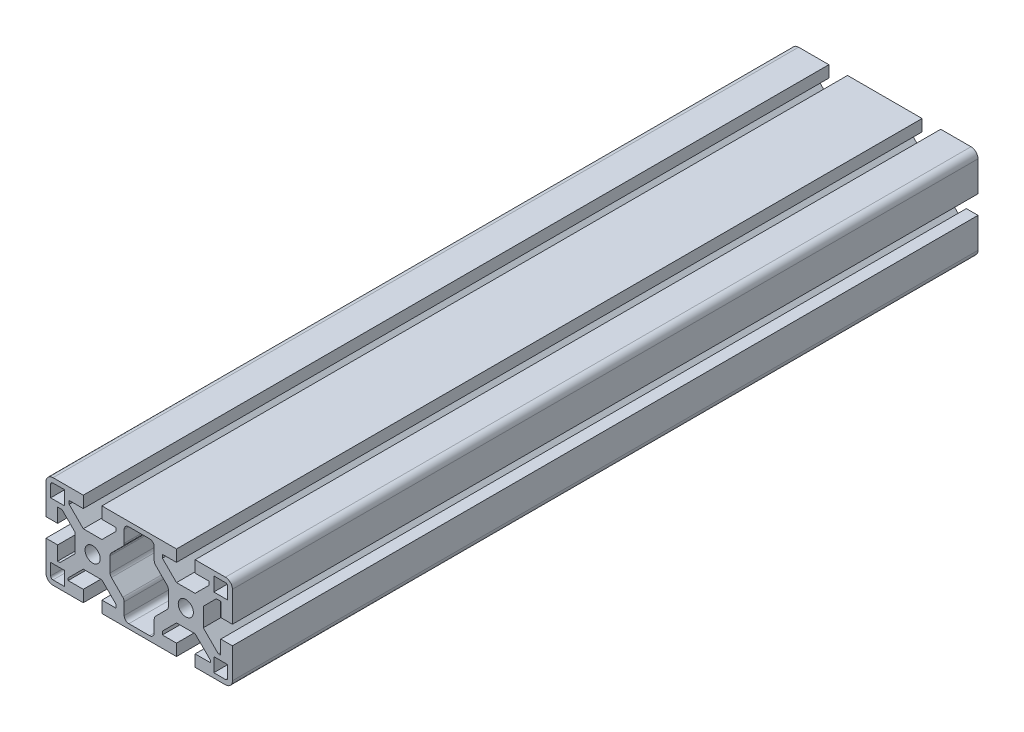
from build123d import *

# Parameters (mm, degrees)
CROQUIS1_R     = 3.25
EXTRUIR5_DEPTH = 320


with BuildPart() as part:
    # Croquis1 → Extruir5 (new body)
    with BuildSketch(Plane.XY):
        with BuildLine():
            Line((50.062875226, 13.55), (50.062875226, 15))
            Line((50.062875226, 15), (44, 15))
            Line((44, 15), (44, 20))
            Line((44, 20), (57, 20))
            ThreePointArc((57, 20), (59.121320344, 19.121320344), (60, 17))
            Line((60, 17), (60, 4))
            Line((60, 4), (55, 4))
            Line((55, 4), (55, 10.05))
            Line((55, 10.05), (53.1, 10.05))
            Line((53.1, 10.05), (47.5, 4.45))
            Line((47.5, 4.45), (47.5, -3.55))
            Line((47.5, -3.55), (54, -10.05))
            Line((54, -10.05), (55, -10.05))
            Line((55, -10.05), (55, -4))
            Line((55, -4), (60, -4))
            Line((60, -4), (60, -17))
            ThreePointArc((60, -17), (59.121320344, -19.121320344), (57, -20))
            Line((57, -20), (44, -20))
            Line((44, -20), (44, -15))
            Line((44, -15), (50.5, -15))
            Line((50.5, -15), (50.5, -14))
            Line((50.5, -14), (44, -7.5))
            Line((44, -7.5), (36, -7.5))
            Line((36, -7.5), (29.95, -13.55))
            Line((29.95, -13.55), (29.95, -15))
            Line((29.95, -15), (36, -15))
            Line((36, -15), (36, -20))
            Line((36, -20), (4, -20))
            Line((4, -20), (4, -15))
            Line((4, -15), (10.05, -15))
            Line((10.05, -15), (10.05, -13.55))
            Line((10.05, -13.55), (4, -7.5))
            Line((4, -7.5), (-4, -7.5))
            Line((-4, -7.5), (-10.5, -14))
            Line((-10.5, -14), (-10.5, -15))
            Line((-10.5, -15), (-4, -15))
            Line((-4, -15), (-4, -20))
            Line((-4, -20), (-17, -20))
            ThreePointArc((-17, -20), (-19.121320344, -19.121320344), (-20, -17))
            Line((-20, -17), (-20, -4))
            Line((-20, -4), (-15, -4))
            Line((-15, -4), (-15, -10.05))
            Line((-15, -10.05), (-14, -10.05))
            Line((-14, -10.05), (-7.5, -3.55))
            Line((-7.5, -3.55), (-7.5, 4.45))
            Line((-7.5, 4.45), (-13.1, 10.05))
            Line((-13.1, 10.05), (-15, 10.05))
            Line((-15, 10.05), (-15, 4))
            Line((-15, 4), (-20, 4))
            Line((-20, 4), (-20, 17))
            ThreePointArc((-20, 17), (-19.121320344, 19.121320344), (-17, 20))
            Line((-17, 20), (-4, 20))
            Line((-4, 20), (-4, 15))
            Line((-4, 15), (-10.062875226, 15))
            Line((-10.062875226, 15), (-10.062875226, 13.55))
            Line((-10.062875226, 13.55), (-4, 7.5))
            Line((-4, 7.5), (4, 7.5))
            Line((4, 7.5), (10.05, 13.55))
            Line((10.05, 13.55), (10.05, 15))
            Line((10.05, 15), (4, 15))
            Line((4, 15), (4, 20))
            Line((4, 20), (36, 20))
            Line((36, 20), (36, 15))
            Line((36, 15), (29.95, 15))
            Line((29.95, 15), (29.95, 13.55))
            Line((29.95, 13.55), (36, 7.5))
            Line((36, 7.5), (44, 7.5))
            Line((44, 7.5), (50.062875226, 13.55))
        make_face()
        Circle(CROQUIS1_R, mode=Mode.SUBTRACT)
        with Locations(Location((40, 0, 0), (0, 0, 180))):
            Circle(CROQUIS1_R, mode=Mode.SUBTRACT)
        with BuildLine():
            Line((-18, 12), (-12, 12))
            Line((-12, 12), (-12, 18))
            Line((-12, 18), (-17, 18))
            ThreePointArc((-17, 18), (-17.707106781, 17.707106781), (-18, 17))
            Line((-18, 17), (-18, 12))
        make_face(mode=Mode.SUBTRACT)
        with BuildLine():
            Line((24.45, 18), (15.55, 18))
            ThreePointArc((15.55, 18), (14.135786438, 17.414213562), (13.55, 16))
            Line((13.55, 16), (13.55, 10.878427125))
            ThreePointArc((13.55, 10.878427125), (13.397759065, 10.11306026), (12.964213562, 9.464213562))
            Line((12.964213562, 9.464213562), (8.085786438, 4.585786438))
            ThreePointArc((8.085786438, 4.585786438), (7.652240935, 3.93693974), (7.5, 3.171572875))
            Line((7.5, 3.171572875), (7.5, -3.171572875))
            ThreePointArc((7.5, -3.171572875), (7.652240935, -3.93693974), (8.085786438, -4.585786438))
            Line((8.085786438, -4.585786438), (12.964213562, -9.464213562))
            ThreePointArc((12.964213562, -9.464213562), (13.397759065, -10.11306026), (13.55, -10.878427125))
            Line((13.55, -10.878427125), (13.55, -16))
            ThreePointArc((13.55, -16), (14.135786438, -17.414213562), (15.55, -18))
            Line((15.55, -18), (24.45, -18))
            ThreePointArc((24.45, -18), (25.864213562, -17.414213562), (26.45, -16))
            Line((26.45, -16), (26.45, -10.878427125))
            ThreePointArc((26.45, -10.878427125), (26.602240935, -10.11306026), (27.035786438, -9.464213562))
            Line((27.035786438, -9.464213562), (31.914213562, -4.585786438))
            ThreePointArc((31.914213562, -4.585786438), (32.347759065, -3.93693974), (32.5, -3.171572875))
            Line((32.5, -3.171572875), (32.5, 3.171572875))
            ThreePointArc((32.5, 3.171572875), (32.347759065, 3.93693974), (31.914213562, 4.585786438))
            Line((31.914213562, 4.585786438), (27.035786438, 9.464213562))
            ThreePointArc((27.035786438, 9.464213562), (26.602240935, 10.11306026), (26.45, 10.878427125))
            Line((26.45, 10.878427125), (26.45, 16))
            ThreePointArc((26.45, 16), (25.864213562, 17.414213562), (24.45, 18))
        make_face(mode=Mode.SUBTRACT)
        with BuildLine():
            Line((-17, -18), (-12, -18))
            Line((-12, -18), (-12, -12))
            Line((-12, -12), (-18, -12))
            Line((-18, -12), (-18, -17))
            ThreePointArc((-18, -17), (-17.707106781, -17.707106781), (-17, -18))
        make_face(mode=Mode.SUBTRACT)
        with BuildLine():
            Line((58, -17), (58, -12))
            Line((58, -12), (52, -12))
            Line((52, -12), (52, -18))
            Line((52, -18), (57, -18))
            ThreePointArc((57, -18), (57.707106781, -17.707106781), (58, -17))
        make_face(mode=Mode.SUBTRACT)
        with BuildLine():
            Line((58, 12), (58, 17))
            ThreePointArc((58, 17), (57.707106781, 17.707106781), (57, 18))
            Line((57, 18), (52, 18))
            Line((52, 18), (52, 12))
            Line((52, 12), (58, 12))
        make_face(mode=Mode.SUBTRACT)
    extrude(amount=EXTRUIR5_DEPTH)


solid = part.part
